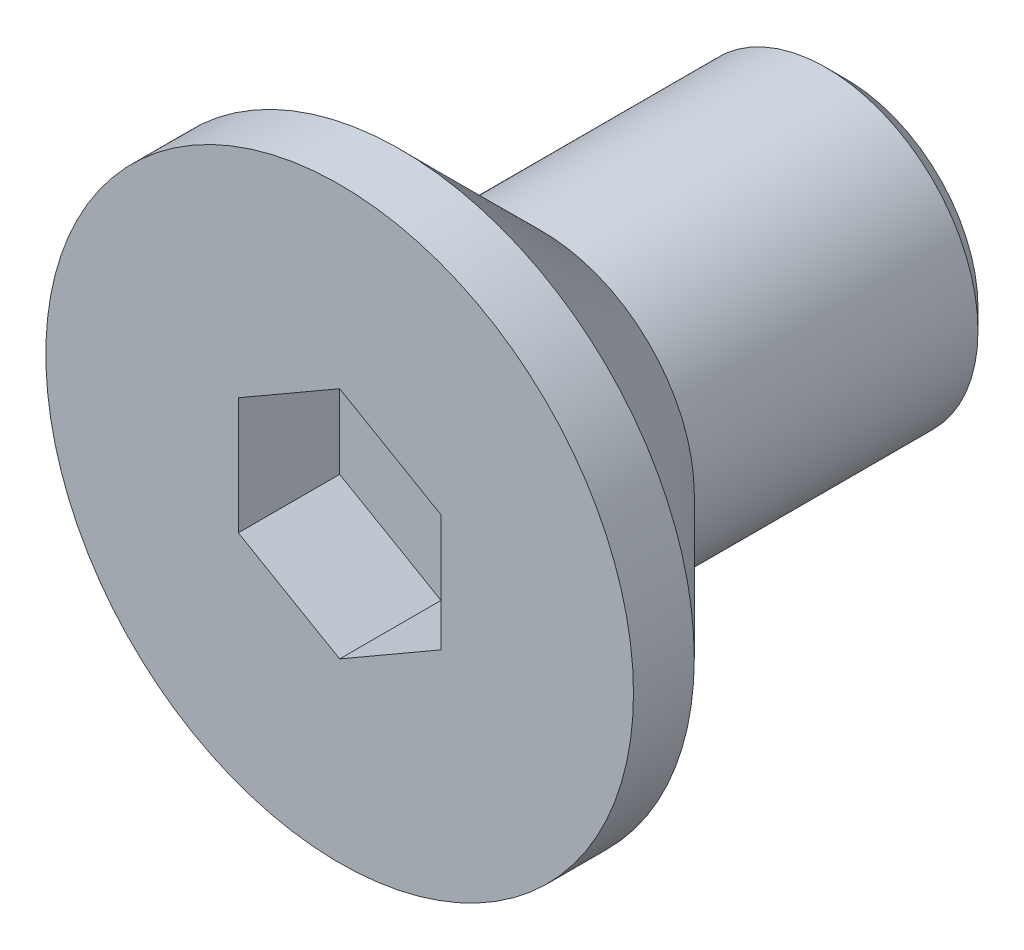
from build123d import *

# Parameters (mm, degrees)
SCHNITT_LINEAR_AUSTRAGEN1_DEPTH = 1
FASE1_SIZE                      = 0.2


with BuildPart() as part:
    # Skizze1 → Rotation1 (revolve)
    with BuildSketch(Plane(origin=(0, 0, 0), x_dir=(0, 0, -1), z_dir=(1, 0, 0)), mode=Mode.PRIVATE) as rotation1_sk:
        Polygon((0, 0), (0, 2.9), (0.6, 2.9), (2, 1.5), (5, 1.5), (5, 0), align=None)
    revolve(rotation1_sk.sketch.rotate(Axis((0, 0, 31.763581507), (0, 0, -1)), 90), axis=Axis((0, 0, 31.763581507), (0, 0, -1)))

    # Skizze3 → Schnitt-Linear austragen1 (cut)
    with BuildSketch(Plane.XY):
        Polygon((1, -0.577350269), (1, 0.577350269), (0, 1.154700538), (-1, 0.577350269), (-1, -0.577350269), (0, -1.154700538), align=None)
    extrude(amount=-SCHNITT_LINEAR_AUSTRAGEN1_DEPTH, mode=Mode.SUBTRACT)

    # Fase1
    fase1_edges = [part.edges().sort_by_distance(p)[0] for p in [
        (-1.5, 0, -5),
    ]]
    chamfer(fase1_edges, length=FASE1_SIZE)


solid = part.part
